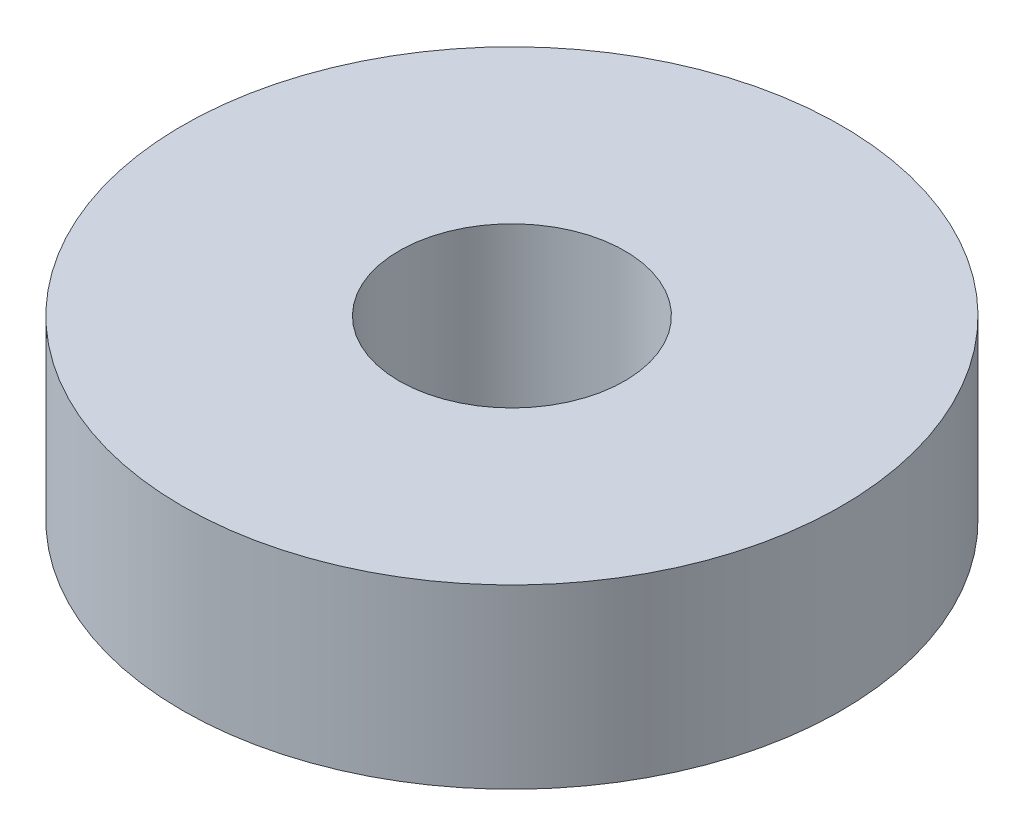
from build123d import *

# Parameters (mm, degrees)
SKETCH1_R           = 9.4615
SKETCH1_R_2         = 3.2385
BOSS_EXTRUDE1_DEPTH = 5.08


with BuildPart() as part:
    # Sketch1 → Boss-Extrude1 (new body)
    with BuildSketch(Plane(origin=(0, 0, 0), x_dir=(1, 0, 0), z_dir=(0, 1, 0))):
        with Locations(Location((0, 0, 0), (0, 0, 270))):
            Circle(SKETCH1_R)
        with Locations(Location((0, 0, 0), (0, 0, 270))):
            Circle(SKETCH1_R_2, mode=Mode.SUBTRACT)
    extrude(amount=BOSS_EXTRUDE1_DEPTH)


solid = part.part
